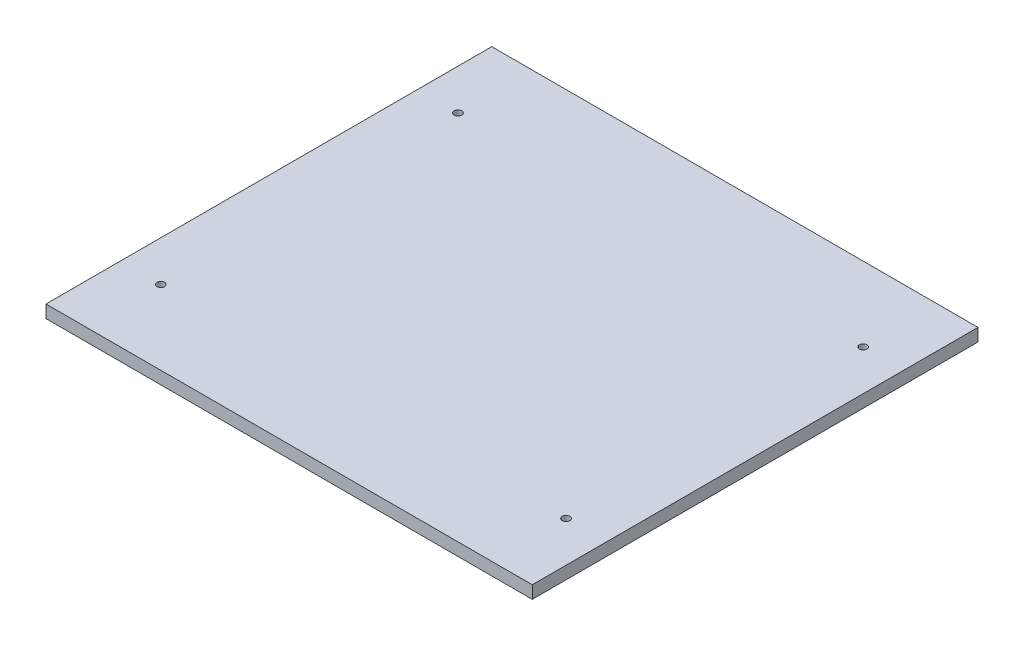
from build123d import *

# Parameters (mm, degrees)
SKETCH1_W                       = 457.2
SKETCH1_H                       = 419.1
BOSS_EXTRUDE1_DEPTH             = 11.90625
F_9_32_0_28125_DIAMETER_HOLE1_D = 7.14375


with BuildPart() as part:
    # Sketch1 → Boss-Extrude1 (new body)
    with BuildSketch(Plane(origin=(0, 0, 0), x_dir=(1, 0, 0), z_dir=(0, 1, 0))):
        Rectangle(SKETCH1_W, SKETCH1_H)
    extrude(amount=BOSS_EXTRUDE1_DEPTH)

    # 9_32 _0.28125_ Diameter Hole1 (through all)
    with Locations(Plane(origin=(0, 11.90625, 0), x_dir=(1, 0, 0), z_dir=(0, 1, 0))):
        with Locations((-190.5, 139.7), (190.5, 139.7), (190.5, -139.7), (-190.5, -139.7)):
            Hole(F_9_32_0_28125_DIAMETER_HOLE1_D / 2)


solid = part.part
